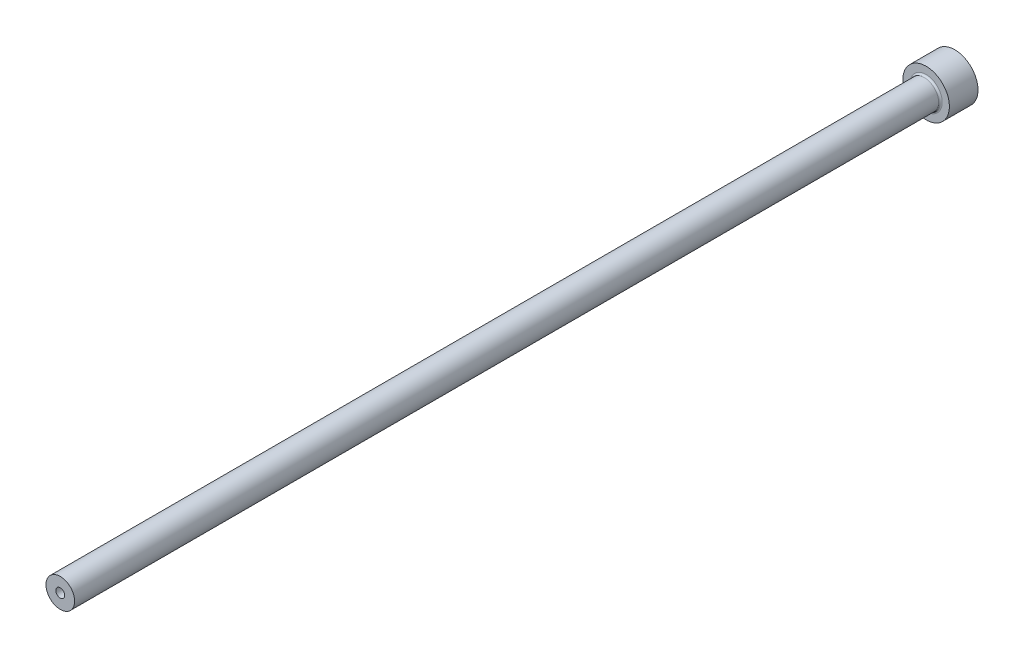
from build123d import *

# Parameters (mm, degrees)
HEAD_FILLET_R          = 0.5
ID_RELIEF_CHAMFER_SIZE = 0.5


with BuildPart() as part:
    # OD FV → Base Revolve (revolve)
    with BuildSketch(Plane(origin=(0, 0, 0), x_dir=(1, 0, 0), z_dir=(0, 1, 0))):
        Polygon((0, -250), (4, -250), (4, -8), (6.5, -8), (6.5, 0), (0, 0), align=None)
    revolve(axis=Axis((0, 0, 250), (0, 0, -1)))

    # ID FV → Hole (revolve, cut)
    with BuildSketch(Plane(origin=(0, 0, 0), x_dir=(1, 0, 0), z_dir=(0, 1, 0))):
        Polygon((0, -250), (1.25, -250), (1.25, -150), (1.5, -149.566987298), (1.5, 0), (0, 0), align=None)
    revolve(axis=Axis((0, 0, 250), (0, 0, -1)), mode=Mode.SUBTRACT)

    # Head Fillet
    head_fillet_edges = [part.edges().sort_by_distance(p)[0] for p in [
        (-4, 0, 8),
    ]]
    fillet(head_fillet_edges, radius=HEAD_FILLET_R)

    # ID Relief Chamfer
    id_relief_chamfer_edges = [part.edges().sort_by_distance(p)[0] for p in [
        (-1.5, 0, 0),
    ]]
    chamfer(id_relief_chamfer_edges, length=ID_RELIEF_CHAMFER_SIZE)


solid = part.part
